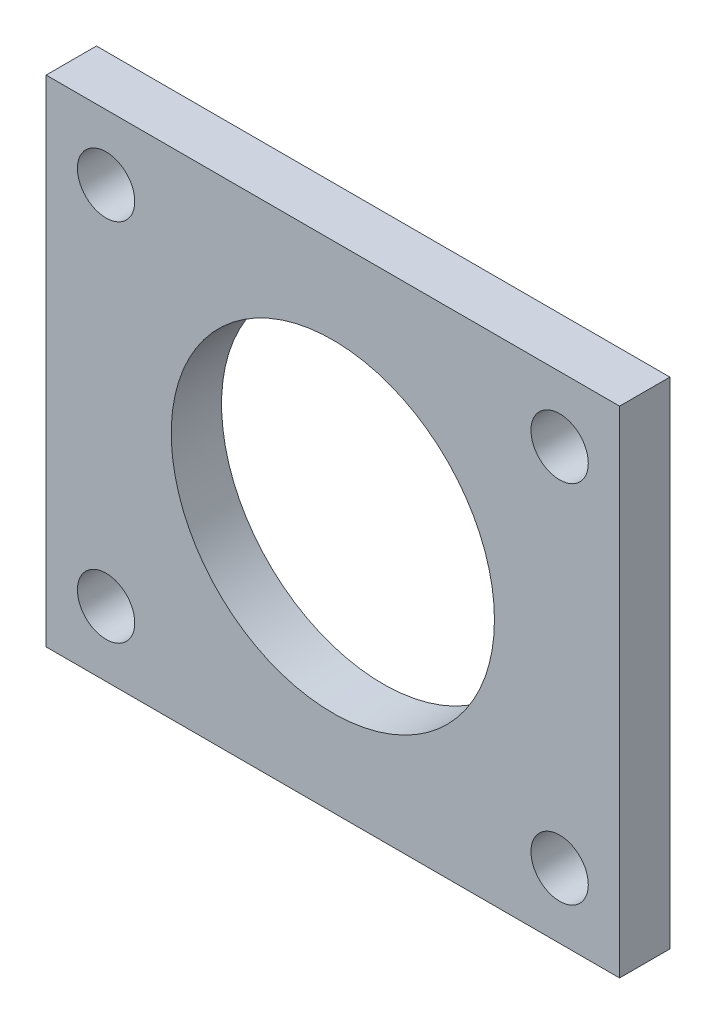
from build123d import *

# Parameters (mm, degrees)
SKETCH1_W           = 110
SKETCH1_H           = 95
SKETCH1_R           = 31
SKETCH1_R_2         = 5.5
BOSS_EXTRUDE1_DEPTH = 9.65


with BuildPart() as part:
    # Sketch1 → Boss-Extrude1 (new body)
    with BuildSketch(Plane.XY):
        Rectangle(SKETCH1_W, SKETCH1_H)
        Circle(SKETCH1_R, mode=Mode.SUBTRACT)
        with Locations((-43.5, 35)):
            Circle(SKETCH1_R_2, mode=Mode.SUBTRACT)
        with Locations((43.5, 35)):
            Circle(SKETCH1_R_2, mode=Mode.SUBTRACT)
        with Locations((43.5, -35)):
            Circle(SKETCH1_R_2, mode=Mode.SUBTRACT)
        with Locations((-43.5, -35)):
            Circle(SKETCH1_R_2, mode=Mode.SUBTRACT)
    extrude(amount=BOSS_EXTRUDE1_DEPTH)


solid = part.part
